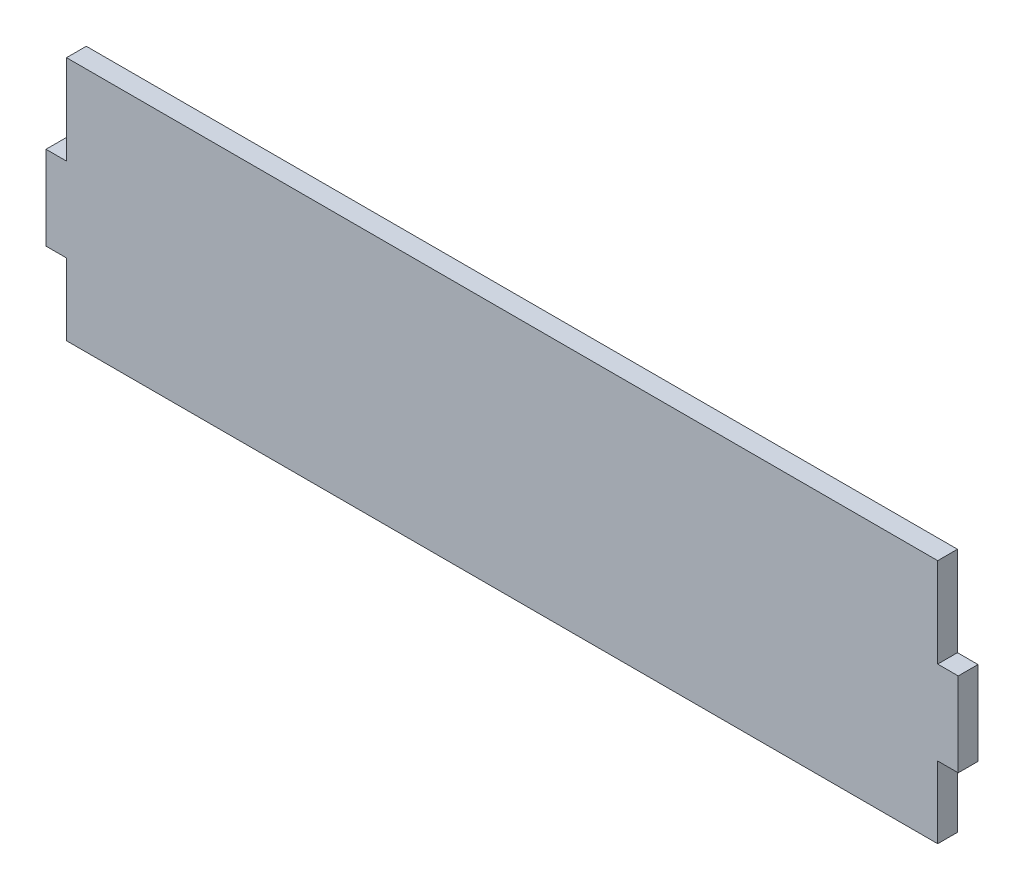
from build123d import *

# Parameters (mm, degrees)
SALIENTE_EXTRUIR1_DEPTH = 2.6


with BuildPart() as part:
    # Croquis1 → Saliente-Extruir1 (new body)
    with BuildSketch(Plane.XY):
        Polygon((48.049956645, 12.461181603), (-66.550043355, 12.461181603), (-66.550043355, 0.676831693), (-69.250043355, 0.676831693), (-69.250043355, -10.361383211), (-66.550043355, -10.361383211), (-66.550043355, -19.790903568), (48.049956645, -19.790903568), (48.049956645, -10.361383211), (50.749956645, -10.361383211), (50.749956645, 0.676831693), (48.049956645, 0.676831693), align=None)
    extrude(amount=SALIENTE_EXTRUIR1_DEPTH)


solid = part.part
